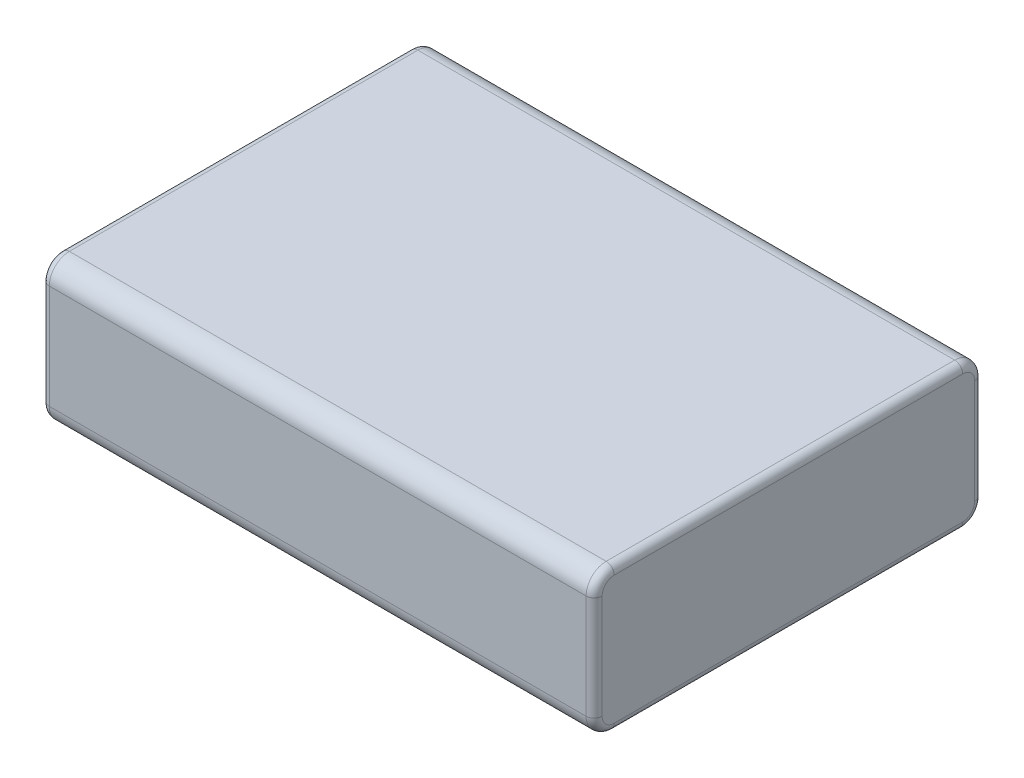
from build123d import *

# Parameters (mm, degrees)
ESQUISSE1_W             = 69
ESQUISSE1_H             = 48.5
BOSS_EXTRU_1_DEPTH      = 18
CONG_1_R                = 2.5
CONG_2_R                = 1
ESQUISSE2_W             = 4.5
ESQUISSE2_H             = 9
ENL_V_MAT_EXTRU_1_DEPTH = 1
ESQUISSE3_W             = 3
ESQUISSE3_H             = 3
BOSS_EXTRU_2_DEPTH      = 3


with BuildPart() as part:
    # Esquisse1 → Boss.-Extru.1 (new body)
    with BuildSketch(Plane(origin=(0, 0, 0), x_dir=(1, 0, 0), z_dir=(0, 1, 0))):
        with Locations((34.5, 24.25)):
            Rectangle(ESQUISSE1_W, ESQUISSE1_H)
    extrude(amount=BOSS_EXTRU_1_DEPTH)

    # Cong_1
    cong_1_edges = [part.edges().sort_by_distance(p)[0] for p in [
        (34.5, 18, -48.5),
        (34.5, 0, -48.5),
        (34.5, 0, 0),
        (34.5, 18, 0),
    ]]
    fillet(cong_1_edges, radius=CONG_1_R)

    # Cong_2
    cong_2_edges = [part.edges().sort_by_distance(p)[0] for p in [
        (0, 9, -48.5),
        (69, 9, -48.5),
        (0, 0, -24.25),
        (0, 9, 0),
        (0, 18, -24.25),
        (0, 17.267766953, -0.732233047),
        (0, 0.732233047, -0.732233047),
        (0, 17.267766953, -47.767766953),
        (0, 0.732233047, -47.767766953),
        (69, 0, -24.25),
        (69, 18, -24.25),
        (69, 9, 0),
        (69, 17.267766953, -0.732233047),
        (69, 0.732233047, -0.732233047),
        (69, 17.267766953, -47.767766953),
        (69, 0.732233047, -47.767766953),
    ]]
    fillet(cong_2_edges, radius=CONG_2_R)

    # Esquisse2 → Enl_v. mat.-Extru.1 (cut)
    with BuildSketch(Plane.XZ):
        with Locations((62.75, -37.5)):
            Rectangle(ESQUISSE2_W, ESQUISSE2_H)
    extrude(amount=-ENL_V_MAT_EXTRU_1_DEPTH, mode=Mode.SUBTRACT)

    # Esquisse3 → Boss.-Extru.2 (add)
    with BuildSketch(Plane.XZ.offset(-1)):
        with Locations((62.75, -35.25)):
            Rectangle(ESQUISSE3_W, ESQUISSE3_H)
    extrude(amount=BOSS_EXTRU_2_DEPTH)


solid = part.part
